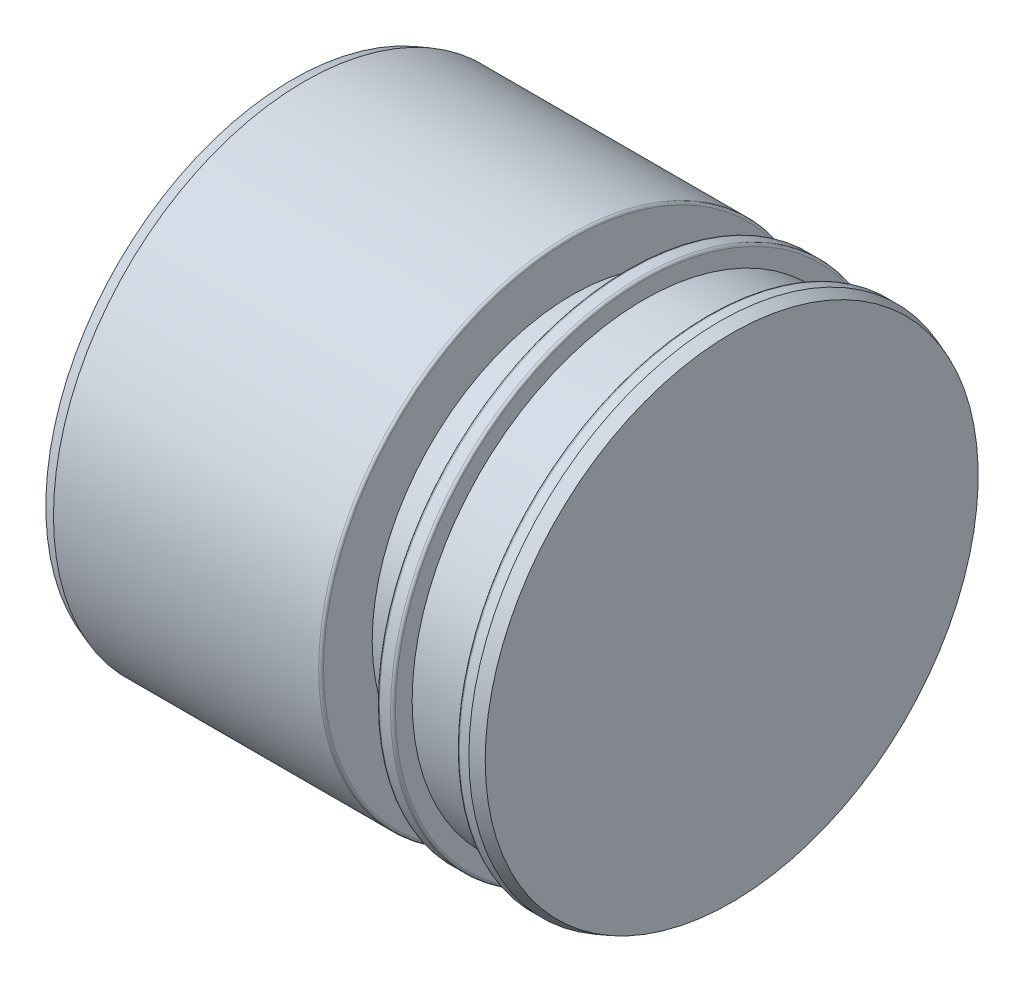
from build123d import *

# Parameters (mm, degrees)
CHANFREIN1_SIZE  = 1.5
CHANFREIN1_SIZE2 = 0.545955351
CHANFREIN2_SIZE  = 1.5
CHANFREIN2_SIZE2 = 0.545955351
CONG_1_R         = 0.3


with BuildPart() as part:
    # Esquisse1 → R_volution1 (revolve)
    with BuildSketch(Plane.XY, mode=Mode.PRIVATE) as r_volution1_sk:
        Polygon((0, 0), (0, 31.4), (35, 31.4), (35, 25), (42, 25), (42, 31.4), (44, 31.4), (44, 29), (52, 29), (52, 31.4), (55, 31.4), (55, 0), align=None)
    revolve(r_volution1_sk.sketch.rotate(Axis((0, 0, 0), (1, 0, 0)), 90), axis=Axis((0, 0, 0), (1, 0, 0)))

    # Esquisse2 → Enl_vement de mati_re-R_volution1 (revolve, cut)
    with BuildSketch(Plane.XY):
        Polygon((0, 0), (0, 20), (33.452994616, 20), (45, 0), align=None)
    revolve(axis=Axis((45, 0, 0), (-1, 0, 0)), mode=Mode.SUBTRACT)

    # Chanfrein1
    chanfrein1_edges = [part.edges().sort_by_distance(p)[0] for p in [
        (0, 0, -31.4),
    ]]
    chanfrein1_side = [part.faces().sort_by_distance(p)[0] for p in [
        (17.5, 0, -31.4),
    ]]
    chamfer(chanfrein1_edges, length=CHANFREIN1_SIZE, length2=CHANFREIN1_SIZE2, reference=chanfrein1_side[0])

    # Chanfrein2
    chanfrein2_edges = [part.edges().sort_by_distance(p)[0] for p in [
        (55, 0, -31.4),
    ]]
    chanfrein2_side = [part.faces().sort_by_distance(p)[0] for p in [
        (53.5, 0, -31.4),
    ]]
    chamfer(chanfrein2_edges, length=CHANFREIN2_SIZE, length2=CHANFREIN2_SIZE2, reference=chanfrein2_side[0])

    # Cong_1
    cong_1_edges = [part.edges().sort_by_distance(p)[0] for p in [
        (35, 0, -31.4),
        (52, 0, -31.4),
        (44, 0, -31.4),
        (42, 0, -31.4),
    ]]
    fillet(cong_1_edges, radius=CONG_1_R)


solid = part.part
